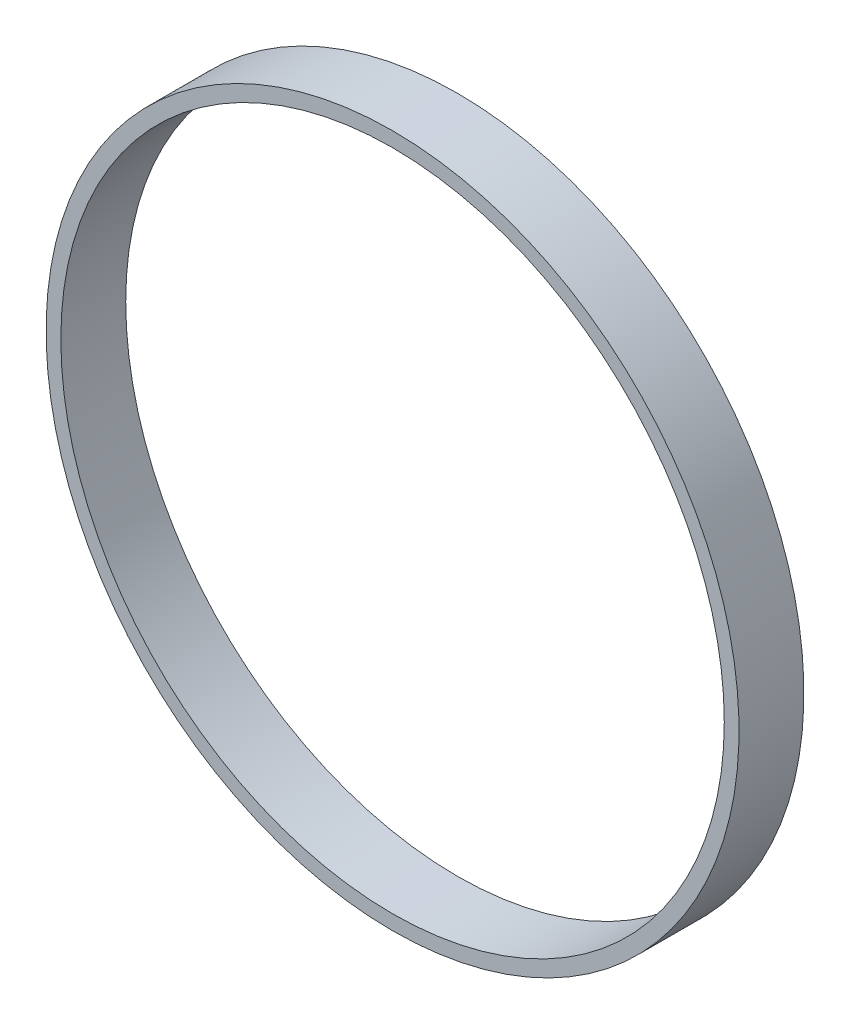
ISO-10303-21;
HEADER;
FILE_DESCRIPTION(('STEP AP214'),'2;1');
FILE_NAME('part.step','',(''),(''),'','','');
FILE_SCHEMA(('AUTOMOTIVE_DESIGN { 1 0 10303 214 1 1 1 1 }'));
ENDSEC;
DATA;
#1=APPLICATION_CONTEXT('core data for automotive mechanical design processes');
#2=APPLICATION_PROTOCOL_DEFINITION('international standard','automotive_design',2000,#1);
#3=PRODUCT_CONTEXT('',#1,'mechanical');
#4=PRODUCT('Part','Part','',(#3));
#5=PRODUCT_RELATED_PRODUCT_CATEGORY('part','',(#4));
#6=PRODUCT_DEFINITION_FORMATION('','',#4);
#7=PRODUCT_DEFINITION_CONTEXT('part definition',#1,'design');
#8=PRODUCT_DEFINITION('design','',#6,#7);
#9=PRODUCT_DEFINITION_SHAPE('','',#8);
#10=(LENGTH_UNIT() NAMED_UNIT(*) SI_UNIT(.MILLI.,.METRE.));
#11=(NAMED_UNIT(*) PLANE_ANGLE_UNIT() SI_UNIT($,.RADIAN.));
#12=(NAMED_UNIT(*) SI_UNIT($,.STERADIAN.) SOLID_ANGLE_UNIT());
#13=UNCERTAINTY_MEASURE_WITH_UNIT(LENGTH_MEASURE(1.E-05),#10,'distance_accuracy_value','');
#14=(GEOMETRIC_REPRESENTATION_CONTEXT(3) GLOBAL_UNCERTAINTY_ASSIGNED_CONTEXT((#13)) GLOBAL_UNIT_ASSIGNED_CONTEXT((#10,
#11,#12)) REPRESENTATION_CONTEXT('',''));
#15=CARTESIAN_POINT('',(0.,0.,0.));
#16=DIRECTION('',(0.,0.,1.));
#17=DIRECTION('',(1.,0.,0.));
#18=AXIS2_PLACEMENT_3D('',#15,#16,#17);
#19=CARTESIAN_POINT('',(0.,0.,12.7));
#20=DIRECTION('',(0.,0.,-1.));
#21=DIRECTION('',(0.,1.,0.));
#22=AXIS2_PLACEMENT_3D('',#19,#20,#21);
#23=CYLINDRICAL_SURFACE('',#22,67.818);
#24=CARTESIAN_POINT('',(0.,0.,12.7));
#25=DIRECTION('',(0.,0.,-1.));
#26=DIRECTION('',(0.,1.,0.));
#27=AXIS2_PLACEMENT_3D('',#24,#25,#26);
#28=CIRCLE('',#27,67.818);
#29=CARTESIAN_POINT('',(0.,67.818,12.7));
#30=VERTEX_POINT('',#29);
#31=EDGE_CURVE('E16',#30,#30,#28,.F.);
#32=ORIENTED_EDGE('',*,*,#31,.F.);
#33=EDGE_LOOP('',(#32));
#34=FACE_BOUND('',#33,.T.);
#35=CARTESIAN_POINT('',(0.,0.,0.));
#36=DIRECTION('',(0.,0.,-1.));
#37=DIRECTION('',(0.,1.,0.));
#38=AXIS2_PLACEMENT_3D('',#35,#36,#37);
#39=CIRCLE('',#38,67.818);
#40=CARTESIAN_POINT('',(0.,67.818,0.));
#41=VERTEX_POINT('',#40);
#42=EDGE_CURVE('E25',#41,#41,#39,.F.);
#43=ORIENTED_EDGE('',*,*,#42,.T.);
#44=EDGE_LOOP('',(#43));
#45=FACE_BOUND('',#44,.T.);
#46=ADVANCED_FACE('F12',(#34,#45),#23,.T.);
#47=CARTESIAN_POINT('',(-68.631816,68.631816,12.7));
#48=DIRECTION('',(0.,0.,1.));
#49=DIRECTION('',(0.,-1.,0.));
#50=AXIS2_PLACEMENT_3D('',#47,#48,#49);
#51=PLANE('',#50);
#52=CARTESIAN_POINT('',(0.,0.,12.7));
#53=DIRECTION('',(0.,0.,-1.));
#54=DIRECTION('',(0.,1.,0.));
#55=AXIS2_PLACEMENT_3D('',#52,#53,#54);
#56=CIRCLE('',#55,64.9351);
#57=CARTESIAN_POINT('',(0.,64.9351,12.7));
#58=VERTEX_POINT('',#57);
#59=EDGE_CURVE('E20',#58,#58,#56,.F.);
#60=ORIENTED_EDGE('',*,*,#59,.F.);
#61=EDGE_LOOP('',(#60));
#62=FACE_BOUND('',#61,.T.);
#63=ORIENTED_EDGE('',*,*,#31,.T.);
#64=EDGE_LOOP('',(#63));
#65=FACE_BOUND('',#64,.T.);
#66=ADVANCED_FACE('F33',(#62,#65),#51,.T.);
#67=CARTESIAN_POINT('',(-68.631816,68.631816,0.));
#68=DIRECTION('',(0.,0.,1.));
#69=DIRECTION('',(0.,-1.,0.));
#70=AXIS2_PLACEMENT_3D('',#67,#68,#69);
#71=PLANE('',#70);
#72=CARTESIAN_POINT('',(0.,0.,0.));
#73=DIRECTION('',(0.,0.,-1.));
#74=DIRECTION('',(0.,1.,0.));
#75=AXIS2_PLACEMENT_3D('',#72,#73,#74);
#76=CIRCLE('',#75,64.9351);
#77=CARTESIAN_POINT('',(0.,64.9351,0.));
#78=VERTEX_POINT('',#77);
#79=EDGE_CURVE('E8',#78,#78,#76,.T.);
#80=ORIENTED_EDGE('',*,*,#79,.F.);
#81=EDGE_LOOP('',(#80));
#82=FACE_BOUND('',#81,.T.);
#83=ORIENTED_EDGE('',*,*,#42,.F.);
#84=EDGE_LOOP('',(#83));
#85=FACE_BOUND('',#84,.T.);
#86=ADVANCED_FACE('F14',(#82,#85),#71,.F.);
#87=CARTESIAN_POINT('',(0.,0.,12.7));
#88=DIRECTION('',(0.,0.,-1.));
#89=DIRECTION('',(0.,1.,0.));
#90=AXIS2_PLACEMENT_3D('',#87,#88,#89);
#91=CYLINDRICAL_SURFACE('',#90,64.9351);
#92=ORIENTED_EDGE('',*,*,#79,.T.);
#93=EDGE_LOOP('',(#92));
#94=FACE_BOUND('',#93,.T.);
#95=ORIENTED_EDGE('',*,*,#59,.T.);
#96=EDGE_LOOP('',(#95));
#97=FACE_BOUND('',#96,.T.);
#98=ADVANCED_FACE('F44',(#94,#97),#91,.F.);
#99=CLOSED_SHELL('',(#46,#66,#86,#98));
#100=MANIFOLD_SOLID_BREP('B1',#99);
#101=ADVANCED_BREP_SHAPE_REPRESENTATION('',(#18,#100),#14);
#102=SHAPE_DEFINITION_REPRESENTATION(#9,#101);
ENDSEC;
END-ISO-10303-21;
